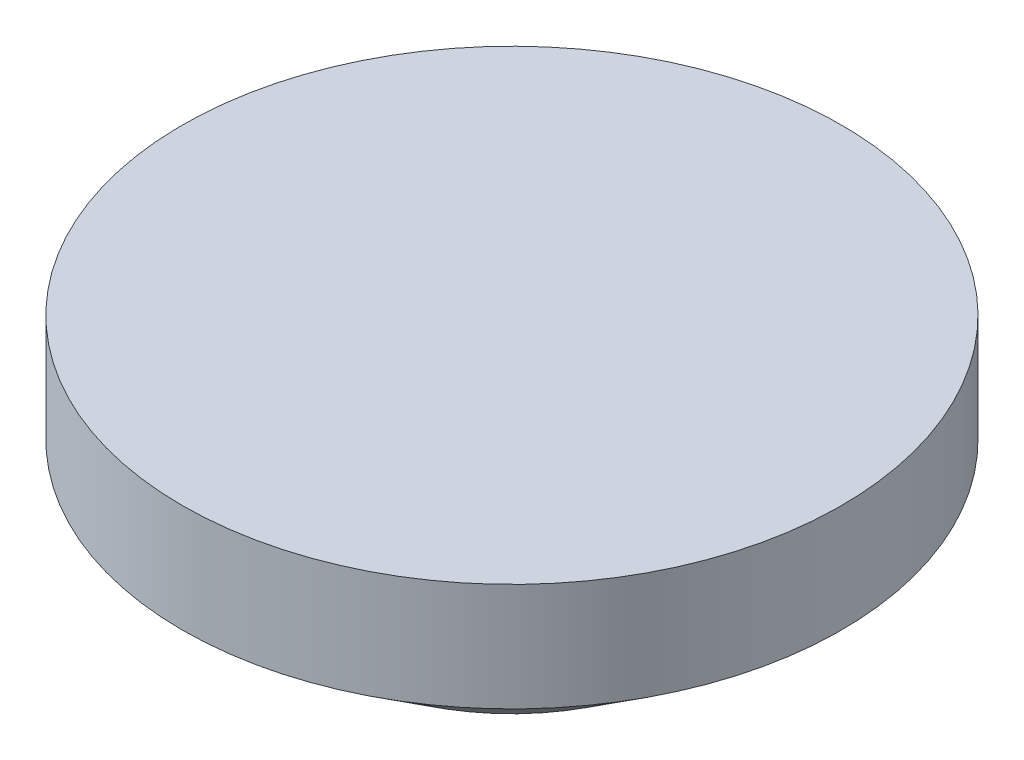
from build123d import *


with BuildPart() as part:
    # Sketch 1 → Revolve 1 (revolve)
    with BuildSketch(Plane.XY, mode=Mode.PRIVATE) as revolve_1_sk:
        Polygon((0, 710), (0, 0), (625, 0), (1100, 350), (1100, 710), align=None)
    revolve(revolve_1_sk.sketch.rotate(Axis((0, 710, 0), (0, -1, 0)), 90), axis=Axis((0, 710, 0), (0, -1, 0)))


solid = part.part
